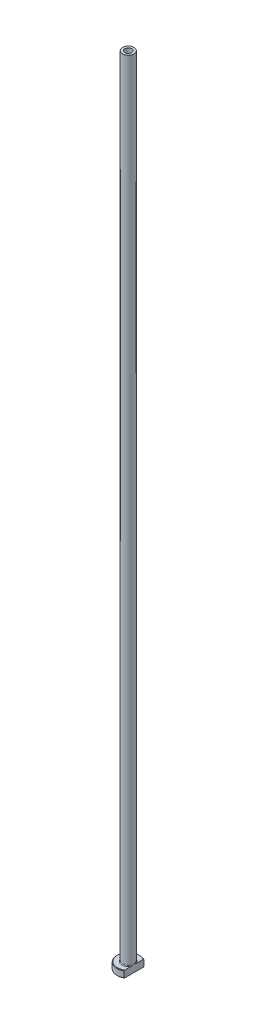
ISO-10303-21;
HEADER;
FILE_DESCRIPTION(('STEP AP214'),'2;1');
FILE_NAME('part.step','',(''),(''),'','','');
FILE_SCHEMA(('AUTOMOTIVE_DESIGN { 1 0 10303 214 1 1 1 1 }'));
ENDSEC;
DATA;
#1=APPLICATION_CONTEXT('core data for automotive mechanical design processes');
#2=APPLICATION_PROTOCOL_DEFINITION('international standard','automotive_design',2000,#1);
#3=PRODUCT_CONTEXT('',#1,'mechanical');
#4=PRODUCT('Part','Part','',(#3));
#5=PRODUCT_RELATED_PRODUCT_CATEGORY('part','',(#4));
#6=PRODUCT_DEFINITION_FORMATION('','',#4);
#7=PRODUCT_DEFINITION_CONTEXT('part definition',#1,'design');
#8=PRODUCT_DEFINITION('design','',#6,#7);
#9=PRODUCT_DEFINITION_SHAPE('','',#8);
#10=(LENGTH_UNIT() NAMED_UNIT(*) SI_UNIT(.MILLI.,.METRE.));
#11=(NAMED_UNIT(*) PLANE_ANGLE_UNIT() SI_UNIT($,.RADIAN.));
#12=(NAMED_UNIT(*) SI_UNIT($,.STERADIAN.) SOLID_ANGLE_UNIT());
#13=UNCERTAINTY_MEASURE_WITH_UNIT(LENGTH_MEASURE(1.E-05),#10,'distance_accuracy_value','');
#14=(GEOMETRIC_REPRESENTATION_CONTEXT(3) GLOBAL_UNCERTAINTY_ASSIGNED_CONTEXT((#13)) GLOBAL_UNIT_ASSIGNED_CONTEXT((#10,
#11,#12)) REPRESENTATION_CONTEXT('',''));
#15=CARTESIAN_POINT('',(0.,0.,0.));
#16=DIRECTION('',(0.,0.,1.));
#17=DIRECTION('',(1.,0.,0.));
#18=AXIS2_PLACEMENT_3D('',#15,#16,#17);
#19=CARTESIAN_POINT('',(0.,92.1876809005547,0.));
#20=DIRECTION('',(0.,1.,0.));
#21=DIRECTION('',(0.,0.,1.));
#22=AXIS2_PLACEMENT_3D('',#19,#20,#21);
#23=CYLINDRICAL_SURFACE('',#22,1.50000000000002);
#24=CARTESIAN_POINT('',(0.,350.,0.));
#25=DIRECTION('',(0.,1.,0.));
#26=DIRECTION('',(0.,0.,1.));
#27=AXIS2_PLACEMENT_3D('',#24,#25,#26);
#28=CIRCLE('',#27,1.50000000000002);
#29=CARTESIAN_POINT('',(0.,350.,1.50000000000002));
#30=VERTEX_POINT('',#29);
#31=EDGE_CURVE('E167',#30,#30,#28,.T.);
#32=ORIENTED_EDGE('',*,*,#31,.T.);
#33=EDGE_LOOP('',(#32));
#34=FACE_BOUND('',#33,.T.);
#35=CARTESIAN_POINT('',(0.,305.,0.));
#36=DIRECTION('',(0.,1.,0.));
#37=DIRECTION('',(0.,0.,1.));
#38=AXIS2_PLACEMENT_3D('',#35,#36,#37);
#39=CIRCLE('',#38,1.50000000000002);
#40=CARTESIAN_POINT('',(0.,305.,1.50000000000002));
#41=VERTEX_POINT('',#40);
#42=EDGE_CURVE('E170',#41,#41,#39,.T.);
#43=ORIENTED_EDGE('',*,*,#42,.F.);
#44=EDGE_LOOP('',(#43));
#45=FACE_BOUND('',#44,.T.);
#46=ADVANCED_FACE('F32',(#34,#45),#23,.F.);
#47=CARTESIAN_POINT('',(-1.50000000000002,350.,0.));
#48=DIRECTION('',(0.,1.,0.));
#49=DIRECTION('',(0.,0.,1.));
#50=AXIS2_PLACEMENT_3D('',#47,#48,#49);
#51=PLANE('',#50);
#52=CARTESIAN_POINT('',(0.,350.,0.));
#53=DIRECTION('',(0.,1.,0.));
#54=DIRECTION('',(0.,0.,1.));
#55=AXIS2_PLACEMENT_3D('',#52,#53,#54);
#56=CIRCLE('',#55,2.50000000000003);
#57=CARTESIAN_POINT('',(0.,350.,2.50000000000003));
#58=VERTEX_POINT('',#57);
#59=EDGE_CURVE('E174',#58,#58,#56,.T.);
#60=ORIENTED_EDGE('',*,*,#59,.T.);
#61=EDGE_LOOP('',(#60));
#62=FACE_BOUND('',#61,.T.);
#63=ORIENTED_EDGE('',*,*,#31,.F.);
#64=EDGE_LOOP('',(#63));
#65=FACE_BOUND('',#64,.T.);
#66=ADVANCED_FACE('F157',(#62,#65),#51,.T.);
#67=CARTESIAN_POINT('',(0.,92.1876809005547,0.));
#68=DIRECTION('',(0.,1.,0.));
#69=DIRECTION('',(0.,0.,1.));
#70=AXIS2_PLACEMENT_3D('',#67,#68,#69);
#71=CYLINDRICAL_SURFACE('',#70,2.50000000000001);
#72=CARTESIAN_POINT('',(0.,3.3,0.));
#73=DIRECTION('',(0.,1.,0.));
#74=DIRECTION('',(0.,0.,1.));
#75=AXIS2_PLACEMENT_3D('',#72,#73,#74);
#76=CIRCLE('',#75,2.50000000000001);
#77=CARTESIAN_POINT('',(2.5,3.3,0.));
#78=VERTEX_POINT('',#77);
#79=EDGE_CURVE('E180',#78,#78,#76,.T.);
#80=ORIENTED_EDGE('',*,*,#79,.T.);
#81=EDGE_LOOP('',(#80));
#82=FACE_BOUND('',#81,.T.);
#83=ORIENTED_EDGE('',*,*,#59,.F.);
#84=EDGE_LOOP('',(#83));
#85=FACE_BOUND('',#84,.T.);
#86=ADVANCED_FACE('F162',(#82,#85),#71,.T.);
#87=CARTESIAN_POINT('',(-2.49999999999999,3.,0.));
#88=DIRECTION('',(0.,1.,0.));
#89=DIRECTION('',(0.,0.,1.));
#90=AXIS2_PLACEMENT_3D('',#87,#88,#89);
#91=PLANE('',#90);
#92=DIRECTION('',(0.,0.,1.));
#93=VECTOR('',#92,1.);
#94=CARTESIAN_POINT('',(2.49999999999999,3.,0.));
#95=LINE('',#94,#93);
#96=CARTESIAN_POINT('',(2.5,3.,-4.09756024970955));
#97=VERTEX_POINT('',#96);
#98=CARTESIAN_POINT('',(2.49999999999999,3.,-1.26095202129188));
#99=VERTEX_POINT('',#98);
#100=EDGE_CURVE('E54',#97,#99,#95,.T.);
#101=ORIENTED_EDGE('',*,*,#100,.F.);
#102=CARTESIAN_POINT('',(0.,3.,0.));
#103=DIRECTION('',(0.,1.,0.));
#104=DIRECTION('',(0.,0.,1.));
#105=AXIS2_PLACEMENT_3D('',#102,#103,#104);
#106=CIRCLE('',#105,4.79999999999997);
#107=CARTESIAN_POINT('',(2.49999999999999,3.,4.09756024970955));
#108=VERTEX_POINT('',#107);
#109=EDGE_CURVE('E186',#97,#108,#106,.T.);
#110=ORIENTED_EDGE('',*,*,#109,.T.);
#111=CARTESIAN_POINT('',(2.49999999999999,3.,1.26095202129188));
#112=VERTEX_POINT('',#111);
#113=EDGE_CURVE('E134',#112,#108,#95,.T.);
#114=ORIENTED_EDGE('',*,*,#113,.F.);
#115=CARTESIAN_POINT('',(0.,3.,0.));
#116=DIRECTION('',(0.,1.,0.));
#117=DIRECTION('',(0.,0.,1.));
#118=AXIS2_PLACEMENT_3D('',#115,#116,#117);
#119=CIRCLE('',#118,2.80000000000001);
#120=EDGE_CURVE('E183',#112,#99,#119,.F.);
#121=ORIENTED_EDGE('',*,*,#120,.T.);
#122=EDGE_LOOP('',(#101,#110,#114,#121));
#123=FACE_BOUND('',#122,.T.);
#124=ADVANCED_FACE('F197',(#123),#91,.T.);
#125=CARTESIAN_POINT('',(0.,92.1876809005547,0.));
#126=DIRECTION('',(0.,1.,0.));
#127=DIRECTION('',(0.,0.,1.));
#128=AXIS2_PLACEMENT_3D('',#125,#126,#127);
#129=CYLINDRICAL_SURFACE('',#128,4.99999999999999);
#130=DIRECTION('',(0.,-1.,0.));
#131=VECTOR('',#130,1.);
#132=CARTESIAN_POINT('',(2.49999999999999,350.,4.33012701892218));
#133=LINE('',#132,#131);
#134=CARTESIAN_POINT('',(2.49999999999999,2.80000000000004,4.33012701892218));
#135=VERTEX_POINT('',#134);
#136=CARTESIAN_POINT('',(2.49999999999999,0.200000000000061,4.33012701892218));
#137=VERTEX_POINT('',#136);
#138=EDGE_CURVE('E82',#135,#137,#133,.T.);
#139=ORIENTED_EDGE('',*,*,#138,.F.);
#140=CARTESIAN_POINT('',(0.,2.80000000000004,0.));
#141=DIRECTION('',(0.,1.,0.));
#142=DIRECTION('',(0.,0.,1.));
#143=AXIS2_PLACEMENT_3D('',#140,#141,#142);
#144=CIRCLE('',#143,4.99999999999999);
#145=CARTESIAN_POINT('',(2.5,2.80000000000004,-4.33012701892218));
#146=VERTEX_POINT('',#145);
#147=EDGE_CURVE('E95',#135,#146,#144,.F.);
#148=ORIENTED_EDGE('',*,*,#147,.T.);
#149=DIRECTION('',(0.,-1.,0.));
#150=VECTOR('',#149,1.);
#151=CARTESIAN_POINT('',(2.5,350.,-4.33012701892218));
#152=LINE('',#151,#150);
#153=CARTESIAN_POINT('',(2.5,0.200000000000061,-4.33012701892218));
#154=VERTEX_POINT('',#153);
#155=EDGE_CURVE('E192',#146,#154,#152,.T.);
#156=ORIENTED_EDGE('',*,*,#155,.T.);
#157=CARTESIAN_POINT('',(0.,0.200000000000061,0.));
#158=DIRECTION('',(0.,-1.,0.));
#159=DIRECTION('',(0.,0.,-1.));
#160=AXIS2_PLACEMENT_3D('',#157,#158,#159);
#161=CIRCLE('',#160,4.99999999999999);
#162=EDGE_CURVE('E98',#154,#137,#161,.F.);
#163=ORIENTED_EDGE('',*,*,#162,.T.);
#164=EDGE_LOOP('',(#139,#148,#156,#163));
#165=FACE_BOUND('',#164,.T.);
#166=ADVANCED_FACE('F190',(#165),#129,.T.);
#167=CARTESIAN_POINT('',(-4.99999999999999,0.,0.));
#168=DIRECTION('',(0.,-1.,0.));
#169=DIRECTION('',(0.,0.,-1.));
#170=AXIS2_PLACEMENT_3D('',#167,#168,#169);
#171=PLANE('',#170);
#172=CARTESIAN_POINT('',(0.,0.,0.));
#173=DIRECTION('',(0.,-1.,0.));
#174=DIRECTION('',(0.,0.,-1.));
#175=AXIS2_PLACEMENT_3D('',#172,#173,#174);
#176=CIRCLE('',#175,2.24999999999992);
#177=CARTESIAN_POINT('',(0.,0.,-2.24999999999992));
#178=VERTEX_POINT('',#177);
#179=EDGE_CURVE('E40',#178,#178,#176,.F.);
#180=ORIENTED_EDGE('',*,*,#179,.T.);
#181=EDGE_LOOP('',(#180));
#182=FACE_BOUND('',#181,.T.);
#183=DIRECTION('',(0.,0.,-1.));
#184=VECTOR('',#183,1.);
#185=CARTESIAN_POINT('',(2.49999999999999,0.,4.33012701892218));
#186=LINE('',#185,#184);
#187=CARTESIAN_POINT('',(2.49999999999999,0.,4.09756024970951));
#188=VERTEX_POINT('',#187);
#189=CARTESIAN_POINT('',(2.5,0.,-4.09756024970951));
#190=VERTEX_POINT('',#189);
#191=EDGE_CURVE('E47',#188,#190,#186,.T.);
#192=ORIENTED_EDGE('',*,*,#191,.F.);
#193=CARTESIAN_POINT('',(0.,0.,0.));
#194=DIRECTION('',(0.,-1.,0.));
#195=DIRECTION('',(0.,0.,-1.));
#196=AXIS2_PLACEMENT_3D('',#193,#194,#195);
#197=CIRCLE('',#196,4.79999999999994);
#198=EDGE_CURVE('E92',#188,#190,#197,.T.);
#199=ORIENTED_EDGE('',*,*,#198,.T.);
#200=EDGE_LOOP('',(#192,#199));
#201=FACE_BOUND('',#200,.T.);
#202=ADVANCED_FACE('F91',(#182,#201),#171,.T.);
#203=CARTESIAN_POINT('',(0.,92.1876809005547,0.));
#204=DIRECTION('',(0.,1.,0.));
#205=DIRECTION('',(0.,0.,1.));
#206=AXIS2_PLACEMENT_3D('',#203,#204,#205);
#207=CYLINDRICAL_SURFACE('',#206,1.75000000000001);
#208=CARTESIAN_POINT('',(0.,0.499999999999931,0.));
#209=DIRECTION('',(0.,-1.,0.));
#210=DIRECTION('',(0.,0.,-1.));
#211=AXIS2_PLACEMENT_3D('',#208,#209,#210);
#212=CIRCLE('',#211,1.75000000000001);
#213=CARTESIAN_POINT('',(0.,0.499999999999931,-1.75000000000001));
#214=VERTEX_POINT('',#213);
#215=EDGE_CURVE('E11',#214,#214,#212,.T.);
#216=ORIENTED_EDGE('',*,*,#215,.T.);
#217=EDGE_LOOP('',(#216));
#218=FACE_BOUND('',#217,.T.);
#219=CARTESIAN_POINT('',(0.,293.,0.));
#220=DIRECTION('',(0.,1.,0.));
#221=DIRECTION('',(0.,0.,1.));
#222=AXIS2_PLACEMENT_3D('',#219,#220,#221);
#223=CIRCLE('',#222,1.75000000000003);
#224=CARTESIAN_POINT('',(0.,293.,1.75000000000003));
#225=VERTEX_POINT('',#224);
#226=EDGE_CURVE('E172',#225,#225,#223,.T.);
#227=ORIENTED_EDGE('',*,*,#226,.T.);
#228=EDGE_LOOP('',(#227));
#229=FACE_BOUND('',#228,.T.);
#230=ADVANCED_FACE('F215',(#218,#229),#207,.F.);
#231=CARTESIAN_POINT('',(0.,293.,0.));
#232=DIRECTION('',(0.,-1.,0.));
#233=DIRECTION('',(0.,0.,-1.));
#234=AXIS2_PLACEMENT_3D('',#231,#232,#233);
#235=CONICAL_SURFACE('',#234,1.75000000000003,0.0208303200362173);
#236=ORIENTED_EDGE('',*,*,#42,.T.);
#237=EDGE_LOOP('',(#236));
#238=FACE_BOUND('',#237,.T.);
#239=ORIENTED_EDGE('',*,*,#226,.F.);
#240=EDGE_LOOP('',(#239));
#241=FACE_BOUND('',#240,.T.);
#242=ADVANCED_FACE('F111',(#238,#241),#235,.F.);
#243=CARTESIAN_POINT('',(0.,3.3,0.));
#244=DIRECTION('',(0.,1.,0.));
#245=DIRECTION('',(0.,0.,1.));
#246=AXIS2_PLACEMENT_3D('',#243,#244,#245);
#247=TOROIDAL_SURFACE('',#246,2.80000000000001,0.3);
#248=ORIENTED_EDGE('',*,*,#120,.F.);
#249=CARTESIAN_POINT('',(2.5,3.3,0.));
#250=CARTESIAN_POINT('',(2.5,3.30000062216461,-4.84331418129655E-11));
#251=CARTESIAN_POINT('',(2.5,3.30000124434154,1.59621145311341E-07));
#252=CARTESIAN_POINT('',(2.5,3.30000243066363,6.45478212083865E-07));
#253=CARTESIAN_POINT('',(2.5,3.30000299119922,9.7848102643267E-07));
#254=CARTESIAN_POINT('',(2.5,3.3000041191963,1.77472029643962E-06));
#255=CARTESIAN_POINT('',(2.5,3.30000467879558,2.24902203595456E-06));
#256=CARTESIAN_POINT('',(2.5,3.30000572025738,3.25953752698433E-06));
#257=CARTESIAN_POINT('',(2.5,3.30000620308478,3.7948081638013E-06));
#258=CARTESIAN_POINT('',(2.5,3.30000787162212,5.75794754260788E-06));
#259=CARTESIAN_POINT('',(2.5,3.30000896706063,7.26424276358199E-06));
#260=CARTESIAN_POINT('',(2.5,3.30001087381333,1.03361149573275E-05));
#261=CARTESIAN_POINT('',(2.5,3.30001169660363,1.18949518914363E-05));
#262=CARTESIAN_POINT('',(2.5,3.30001489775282,1.81400885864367E-05));
#263=CARTESIAN_POINT('',(2.5,3.30001712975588,2.29062223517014E-05));
#264=CARTESIAN_POINT('',(2.5,3.30002067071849,3.21793921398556E-05));
#265=CARTESIAN_POINT('',(2.5,3.30002205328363,3.66589040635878E-05));
#266=CARTESIAN_POINT('',(2.5,3.30002810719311,5.61718487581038E-05));
#267=CARTESIAN_POINT('',(2.5,3.30003284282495,7.11735978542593E-05));
#268=CARTESIAN_POINT('',(2.5,3.30004025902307,9.89920465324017E-05));
#269=CARTESIAN_POINT('',(2.5,3.300043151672,0.000111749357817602));
#270=CARTESIAN_POINT('',(2.49999999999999,3.30006652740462,0.000206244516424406));
#271=CARTESIAN_POINT('',(2.49999999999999,3.30009698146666,0.000285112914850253));
#272=CARTESIAN_POINT('',(2.5,3.3002121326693,0.000594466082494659));
#273=CARTESIAN_POINT('',(2.5,3.30028938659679,0.000826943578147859));
#274=CARTESIAN_POINT('',(2.49999999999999,3.30059681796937,0.00173885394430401));
#275=CARTESIAN_POINT('',(2.49999999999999,3.30083479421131,0.00241625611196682));
#276=CARTESIAN_POINT('',(2.5,3.30181198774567,0.00521069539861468));
#277=CARTESIAN_POINT('',(2.5,3.30254240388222,0.00732996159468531));
#278=CARTESIAN_POINT('',(2.49999999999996,3.31226043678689,0.0355096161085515));
#279=CARTESIAN_POINT('',(2.49999999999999,3.32130808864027,0.0615551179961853));
#280=CARTESIAN_POINT('',(2.5,3.33896212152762,0.112677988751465));
#281=CARTESIAN_POINT('',(2.5,3.34757212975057,0.137754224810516));
#282=CARTESIAN_POINT('',(2.49999999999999,3.36573068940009,0.190981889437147));
#283=CARTESIAN_POINT('',(2.49999999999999,3.37526654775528,0.219137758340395));
#284=CARTESIAN_POINT('',(2.5,3.3942286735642,0.275816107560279));
#285=CARTESIAN_POINT('',(2.5,3.40365272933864,0.30433932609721));
#286=CARTESIAN_POINT('',(2.49999999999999,3.4264169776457,0.374416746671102));
#287=CARTESIAN_POINT('',(2.5,3.43959811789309,0.4160230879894));
#288=CARTESIAN_POINT('',(2.5,3.46479157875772,0.498481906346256));
#289=CARTESIAN_POINT('',(2.5,3.4768245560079,0.539328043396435));
#290=CARTESIAN_POINT('',(2.5,3.50224427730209,0.629981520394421));
#291=CARTESIAN_POINT('',(2.5,3.51538048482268,0.679860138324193));
#292=CARTESIAN_POINT('',(2.5,3.53964074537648,0.780511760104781));
#293=CARTESIAN_POINT('',(2.5,3.55074877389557,0.831288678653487));
#294=CARTESIAN_POINT('',(2.5,3.57087054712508,0.93706346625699));
#295=CARTESIAN_POINT('',(2.5,3.57967623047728,0.992102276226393));
#296=CARTESIAN_POINT('',(2.5,3.59301148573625,1.10256024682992));
#297=CARTESIAN_POINT('',(2.5,3.59755297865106,1.15797790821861));
#298=CARTESIAN_POINT('',(2.5,3.60093314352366,1.26786705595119));
#299=CARTESIAN_POINT('',(2.5,3.59989366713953,1.32233291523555));
#300=CARTESIAN_POINT('',(2.5,3.59277279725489,1.40310062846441));
#301=CARTESIAN_POINT('',(2.5,3.58952137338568,1.42965222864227));
#302=CARTESIAN_POINT('',(2.5,3.58085857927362,1.48239078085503));
#303=CARTESIAN_POINT('',(2.5,3.57544928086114,1.50857805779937));
#304=CARTESIAN_POINT('',(2.5,3.56298810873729,1.55658799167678));
#305=CARTESIAN_POINT('',(2.5,3.55628200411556,1.57849902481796));
#306=CARTESIAN_POINT('',(2.5,3.54055393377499,1.62160292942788));
#307=CARTESIAN_POINT('',(2.5,3.53152220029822,1.64279233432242));
#308=CARTESIAN_POINT('',(2.5,3.51057199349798,1.68404469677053));
#309=CARTESIAN_POINT('',(2.5,3.49862012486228,1.70409105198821));
#310=CARTESIAN_POINT('',(2.5,3.47134074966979,1.74172093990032));
#311=CARTESIAN_POINT('',(2.5,3.45603127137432,1.75931683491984));
#312=CARTESIAN_POINT('',(2.5,3.42979930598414,1.7829707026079));
#313=CARTESIAN_POINT('',(2.5,3.42024268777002,1.790541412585));
#314=CARTESIAN_POINT('',(2.5,3.40009035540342,1.80416997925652));
#315=CARTESIAN_POINT('',(2.5,3.38949499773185,1.81022835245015));
#316=CARTESIAN_POINT('',(2.5,3.36727740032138,1.82047087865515));
#317=CARTESIAN_POINT('',(2.5,3.35564531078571,1.82463409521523));
#318=CARTESIAN_POINT('',(2.5,3.33178837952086,1.83058442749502));
#319=CARTESIAN_POINT('',(2.5,3.31956435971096,1.83237474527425));
#320=CARTESIAN_POINT('',(2.5,3.2966573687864,1.8333185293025));
#321=CARTESIAN_POINT('',(2.5,3.28598670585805,1.83279233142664));
#322=CARTESIAN_POINT('',(2.5,3.26490749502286,1.82986307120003));
#323=CARTESIAN_POINT('',(2.5,3.2544989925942,1.82745968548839));
#324=CARTESIAN_POINT('',(2.5,3.23467098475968,1.8211125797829));
#325=CARTESIAN_POINT('',(2.5,3.22522816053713,1.81724026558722));
#326=CARTESIAN_POINT('',(2.5,3.20699535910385,1.8081949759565));
#327=CARTESIAN_POINT('',(2.5,3.19820556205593,1.80302164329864));
#328=CARTESIAN_POINT('',(2.5,3.17663162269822,1.78842115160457));
#329=CARTESIAN_POINT('',(2.5,3.16436228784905,1.77823293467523));
#330=CARTESIAN_POINT('',(2.5,3.14157828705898,1.75604629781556));
#331=CARTESIAN_POINT('',(2.5,3.13106906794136,1.74404246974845));
#332=CARTESIAN_POINT('',(2.5,3.10600520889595,1.71142114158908));
#333=CARTESIAN_POINT('',(2.5,3.09267476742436,1.68986887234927));
#334=CARTESIAN_POINT('',(2.5,3.06940323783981,1.64508572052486));
#335=CARTESIAN_POINT('',(2.5,3.05946314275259,1.6218543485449));
#336=CARTESIAN_POINT('',(2.5,3.03545750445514,1.55546754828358));
#337=CARTESIAN_POINT('',(2.5,3.02444022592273,1.51122187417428));
#338=CARTESIAN_POINT('',(2.5,3.00863926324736,1.42119777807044));
#339=CARTESIAN_POINT('',(2.5,3.00393876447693,1.37540689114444));
#340=CARTESIAN_POINT('',(2.5,2.9992421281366,1.28072198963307));
#341=CARTESIAN_POINT('',(2.5,2.99956098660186,1.23181420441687));
#342=CARTESIAN_POINT('',(2.5,3.00436098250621,1.1341094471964));
#343=CARTESIAN_POINT('',(2.5,3.00885327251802,1.08531312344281));
#344=CARTESIAN_POINT('',(2.5,3.02074191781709,0.990773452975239));
#345=CARTESIAN_POINT('',(2.5,3.02796792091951,0.945007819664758));
#346=CARTESIAN_POINT('',(2.5,3.04465555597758,0.854199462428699));
#347=CARTESIAN_POINT('',(2.5,3.05410250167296,0.809153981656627));
#348=CARTESIAN_POINT('',(2.5,3.07710029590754,0.709411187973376));
#349=CARTESIAN_POINT('',(2.5,3.09109633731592,0.654817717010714));
#350=CARTESIAN_POINT('',(2.5,3.12140740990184,0.544863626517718));
#351=CARTESIAN_POINT('',(2.49999999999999,3.13777040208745,0.489516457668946));
#352=CARTESIAN_POINT('',(2.5,3.16649540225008,0.396740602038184));
#353=CARTESIAN_POINT('',(2.5,3.1784813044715,0.359193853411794));
#354=CARTESIAN_POINT('',(2.49999999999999,3.20280507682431,0.284651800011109));
#355=CARTESIAN_POINT('',(2.49999999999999,3.21513791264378,0.247654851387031));
#356=CARTESIAN_POINT('',(2.5,3.23873713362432,0.177767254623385));
#357=CARTESIAN_POINT('',(2.50000000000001,3.2499740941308,0.144866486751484));
#358=CARTESIAN_POINT('',(2.49999999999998,3.27307149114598,0.0777985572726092));
#359=CARTESIAN_POINT('',(2.49999999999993,3.28493883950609,0.0436336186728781));
#360=CARTESIAN_POINT('',(2.5,3.2974579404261,0.00732879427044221));
#361=CARTESIAN_POINT('',(2.5,3.29818879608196,0.00520838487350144));
#362=CARTESIAN_POINT('',(2.49999999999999,3.29916610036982,0.00241367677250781));
#363=CARTESIAN_POINT('',(2.49999999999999,3.29940376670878,0.00173715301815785));
#364=CARTESIAN_POINT('',(2.5,3.29971082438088,0.000826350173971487));
#365=CARTESIAN_POINT('',(2.5,3.29978800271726,0.00059409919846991));
#366=CARTESIAN_POINT('',(2.49999999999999,3.29990305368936,0.000285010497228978));
#367=CARTESIAN_POINT('',(2.49999999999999,3.29993349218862,0.000206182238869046));
#368=CARTESIAN_POINT('',(2.5,3.29995685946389,0.000111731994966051));
#369=CARTESIAN_POINT('',(2.5,3.29995975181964,9.89774459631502E-05));
#370=CARTESIAN_POINT('',(2.5,3.29996716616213,7.11651995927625E-05));
#371=CARTESIAN_POINT('',(2.5,3.29997189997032,5.61668178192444E-05));
#372=CARTESIAN_POINT('',(2.5,3.29997795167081,3.66576379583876E-05));
#373=CARTESIAN_POINT('',(2.5,3.29997933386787,3.21785298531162E-05));
#374=CARTESIAN_POINT('',(2.5,3.29998287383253,2.29061419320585E-05));
#375=CARTESIAN_POINT('',(2.5,3.29998510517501,1.81403694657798E-05));
#376=CARTESIAN_POINT('',(2.5,3.29998830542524,1.18955841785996E-05));
#377=CARTESIAN_POINT('',(2.5,3.29998912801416,1.03367781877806E-05));
#378=CARTESIAN_POINT('',(2.5,3.29999103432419,7.26492948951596E-06));
#379=CARTESIAN_POINT('',(2.5,3.29999212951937,5.75862409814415E-06));
#380=CARTESIAN_POINT('',(2.5,3.29999379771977,3.79542544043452E-06));
#381=CARTESIAN_POINT('',(2.5,3.29999428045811,3.26012835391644E-06));
#382=CARTESIAN_POINT('',(2.5,3.29999532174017,2.24954393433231E-06));
#383=CARTESIAN_POINT('',(2.5,3.29999588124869,1.77519943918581E-06));
#384=CARTESIAN_POINT('',(2.5,3.29999700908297,9.78857422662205E-07));
#385=CARTESIAN_POINT('',(2.5,3.29999756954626,6.45797309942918E-07));
#386=CARTESIAN_POINT('',(2.5,3.29999875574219,1.59799707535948E-07));
#387=CARTESIAN_POINT('',(2.5,3.29999937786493,4.84313429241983E-11));
#388=CARTESIAN_POINT('',(2.5,3.3,0.));
#389=B_SPLINE_CURVE_WITH_KNOTS('',3,(#249,#250,#251,#252,#253,#254,#255,#256,#257,#258,#259,
#260,#261,#262,#263,#264,#265,#266,#267,#268,#269,#270,#271,#272,#273,#274,#275,#276,#277,#278,
#279,#280,#281,#282,#283,#284,#285,#286,#287,#288,#289,#290,#291,#292,#293,#294,#295,#296,#297,
#298,#299,#300,#301,#302,#303,#304,#305,#306,#307,#308,#309,#310,#311,#312,#313,#314,#315,#316,
#317,#318,#319,#320,#321,#322,#323,#324,#325,#326,#327,#328,#329,#330,#331,#332,#333,#334,#335,
#336,#337,#338,#339,#340,#341,#342,#343,#344,#345,#346,#347,#348,#349,#350,#351,#352,#353,#354,
#355,#356,#357,#358,#359,#360,#361,#362,#363,#364,#365,#366,#367,#368,#369,#370,#371,#372,#373,
#374,#375,#376,#377,#378,#379,#380,#381,#382,#383,#384,#385,#386,#387,#388),.UNSPECIFIED.,.T.,
.F.,(4,2,2,2,2,2,2,2,2,2,2,2,2,2,2,2,2,2,2,2,2,2,2,2,2,2,2,2,2,2,2,2,2,2,2,2,2,2,2,2,2,2,2,2,2,
2,2,2,2,2,2,2,2,2,2,2,2,2,2,2,2,2,2,2,2,2,2,2,2,4),(0.,1.86789035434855E-06,3.815492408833E-06,
6.00609972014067E-06,8.16652330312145E-06,1.37285513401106E-05,1.90122074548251E-05,
3.47597195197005E-05,4.88082497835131E-05,9.59978367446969E-05,0.000135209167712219,
0.000388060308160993,0.00112364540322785,0.00327678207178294,0.010002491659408,
0.0927120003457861,0.172253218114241,0.261432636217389,0.35155121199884,0.482477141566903,
0.610212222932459,0.76491521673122,0.920792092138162,1.08787897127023,1.25449733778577,
1.41749285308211,1.49767530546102,1.57778095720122,1.64642481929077,1.7153618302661,
1.78512750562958,1.85452737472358,1.89099315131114,1.92744645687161,1.96429324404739,
2.00109025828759,2.03297105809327,2.06485735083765,2.09535926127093,2.12586955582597,
2.17344034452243,2.22115572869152,2.29675134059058,2.37236907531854,2.50839721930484,
2.64619971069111,2.79268284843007,2.93955855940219,3.07848421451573,3.21651583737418,
3.38554045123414,3.55865938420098,3.67689643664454,3.79388863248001,3.89819085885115,
4.00668323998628,4.01341261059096,4.01556295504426,4.01629782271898,4.01655054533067,
4.01658974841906,4.01663692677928,4.01665097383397,4.01666671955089,4.01667200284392,
4.0166775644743,4.0166797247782,4.01668191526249,4.016683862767,4.01668573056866),.UNSPECIFIED.);
#390=EDGE_CURVE('E126',#112,#78,#389,.T.);
#391=ORIENTED_EDGE('',*,*,#390,.T.);
#392=ORIENTED_EDGE('',*,*,#79,.F.);
#393=CARTESIAN_POINT('',(2.5,3.3,0.));
#394=CARTESIAN_POINT('',(2.5,3.29999937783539,4.84339385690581E-11));
#395=CARTESIAN_POINT('',(2.5,3.29999875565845,-1.59621144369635E-07));
#396=CARTESIAN_POINT('',(2.5,3.29999756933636,-6.45478211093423E-07));
#397=CARTESIAN_POINT('',(2.5,3.29999700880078,-9.78481025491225E-07));
#398=CARTESIAN_POINT('',(2.5,3.29999588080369,-1.7747202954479E-06));
#399=CARTESIAN_POINT('',(2.5,3.29999532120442,-2.24902203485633E-06));
#400=CARTESIAN_POINT('',(2.5,3.29999427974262,-3.25953752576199E-06));
#401=CARTESIAN_POINT('',(2.5,3.29999379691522,-3.7948081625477E-06));
#402=CARTESIAN_POINT('',(2.5,3.29999212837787,-5.75794754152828E-06));
#403=CARTESIAN_POINT('',(2.5,3.29999103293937,-7.2642427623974E-06));
#404=CARTESIAN_POINT('',(2.5,3.29998912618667,-1.03361149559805E-05));
#405=CARTESIAN_POINT('',(2.5,3.29998830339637,-1.18949518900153E-05));
#406=CARTESIAN_POINT('',(2.5,3.29998510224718,-1.81400885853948E-05));
#407=CARTESIAN_POINT('',(2.5,3.29998287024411,-2.29062223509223E-05));
#408=CARTESIAN_POINT('',(2.5,3.2999793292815,-3.21793921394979E-05));
#409=CARTESIAN_POINT('',(2.5,3.29997794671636,-3.66589040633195E-05));
#410=CARTESIAN_POINT('',(2.5,3.29997189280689,-5.61718487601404E-05));
#411=CARTESIAN_POINT('',(2.5,3.29996715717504,-7.11735978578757E-05));
#412=CARTESIAN_POINT('',(2.5,3.29995974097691,-9.899204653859E-05));
#413=CARTESIAN_POINT('',(2.5,3.29995684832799,-0.000111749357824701));
#414=CARTESIAN_POINT('',(2.49999999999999,3.29993347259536,-0.000206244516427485));
#415=CARTESIAN_POINT('',(2.49999999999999,3.29990301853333,-0.000285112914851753));
#416=CARTESIAN_POINT('',(2.5,3.29978786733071,-0.000594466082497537));
#417=CARTESIAN_POINT('',(2.5,3.29971061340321,-0.000826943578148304));
#418=CARTESIAN_POINT('',(2.49999999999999,3.29940318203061,-0.00173885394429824));
#419=CARTESIAN_POINT('',(2.49999999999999,3.29916520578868,-0.00241625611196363));
#420=CARTESIAN_POINT('',(2.5,3.29818801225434,-0.0052106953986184));
#421=CARTESIAN_POINT('',(2.5,3.29745759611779,-0.00732996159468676));
#422=CARTESIAN_POINT('',(2.49999999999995,3.28773956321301,-0.0355096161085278));
#423=CARTESIAN_POINT('',(2.49999999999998,3.2786919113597,-0.0615551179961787));
#424=CARTESIAN_POINT('',(2.50000000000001,3.2610378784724,-0.11267798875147));
#425=CARTESIAN_POINT('',(2.5,3.25242787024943,-0.137754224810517));
#426=CARTESIAN_POINT('',(2.49999999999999,3.23426931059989,-0.190981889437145));
#427=CARTESIAN_POINT('',(2.49999999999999,3.22473345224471,-0.219137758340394));
#428=CARTESIAN_POINT('',(2.5,3.2057713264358,-0.275816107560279));
#429=CARTESIAN_POINT('',(2.5,3.19634727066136,-0.304339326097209));
#430=CARTESIAN_POINT('',(2.49999999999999,3.1735830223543,-0.374416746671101));
#431=CARTESIAN_POINT('',(2.5,3.1604018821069,-0.416023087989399));
#432=CARTESIAN_POINT('',(2.5,3.13520842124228,-0.498481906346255));
#433=CARTESIAN_POINT('',(2.5,3.12317544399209,-0.539328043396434));
#434=CARTESIAN_POINT('',(2.5,3.09775572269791,-0.629981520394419));
#435=CARTESIAN_POINT('',(2.5,3.08461951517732,-0.679860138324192));
#436=CARTESIAN_POINT('',(2.5,3.06035925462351,-0.780511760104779));
#437=CARTESIAN_POINT('',(2.5,3.04925122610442,-0.831288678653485));
#438=CARTESIAN_POINT('',(2.5,3.02912945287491,-0.937063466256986));
#439=CARTESIAN_POINT('',(2.5,3.02032376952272,-0.992102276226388));
#440=CARTESIAN_POINT('',(2.5,3.00698851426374,-1.10256024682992));
#441=CARTESIAN_POINT('',(2.5,3.00244702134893,-1.1579779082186));
#442=CARTESIAN_POINT('',(2.5,2.99906685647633,-1.26786705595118));
#443=CARTESIAN_POINT('',(2.5,3.00010633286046,-1.32233291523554));
#444=CARTESIAN_POINT('',(2.5,3.00722720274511,-1.4031006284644));
#445=CARTESIAN_POINT('',(2.5,3.01047862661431,-1.42965222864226));
#446=CARTESIAN_POINT('',(2.5,3.01914142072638,-1.48239078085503));
#447=CARTESIAN_POINT('',(2.5,3.02455071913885,-1.50857805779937));
#448=CARTESIAN_POINT('',(2.5,3.0370118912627,-1.55658799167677));
#449=CARTESIAN_POINT('',(2.5,3.04371799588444,-1.57849902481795));
#450=CARTESIAN_POINT('',(2.5,3.05944606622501,-1.62160292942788));
#451=CARTESIAN_POINT('',(2.5,3.06847779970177,-1.64279233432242));
#452=CARTESIAN_POINT('',(2.5,3.08942800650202,-1.68404469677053));
#453=CARTESIAN_POINT('',(2.5,3.10137987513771,-1.70409105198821));
#454=CARTESIAN_POINT('',(2.5,3.1286592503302,-1.74172093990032));
#455=CARTESIAN_POINT('',(2.5,3.14396872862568,-1.75931683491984));
#456=CARTESIAN_POINT('',(2.5,3.17020069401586,-1.7829707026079));
#457=CARTESIAN_POINT('',(2.5,3.17975731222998,-1.79054141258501));
#458=CARTESIAN_POINT('',(2.5,3.19990964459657,-1.80416997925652));
#459=CARTESIAN_POINT('',(2.5,3.21050500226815,-1.81022835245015));
#460=CARTESIAN_POINT('',(2.5,3.23272259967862,-1.82047087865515));
#461=CARTESIAN_POINT('',(2.5,3.24435468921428,-1.82463409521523));
#462=CARTESIAN_POINT('',(2.5,3.26821162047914,-1.83058442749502));
#463=CARTESIAN_POINT('',(2.5,3.28043564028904,-1.83237474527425));
#464=CARTESIAN_POINT('',(2.5,3.3033426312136,-1.8333185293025));
#465=CARTESIAN_POINT('',(2.5,3.31401329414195,-1.83279233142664));
#466=CARTESIAN_POINT('',(2.5,3.33509250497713,-1.82986307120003));
#467=CARTESIAN_POINT('',(2.5,3.34550100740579,-1.82745968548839));
#468=CARTESIAN_POINT('',(2.5,3.36532901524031,-1.8211125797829));
#469=CARTESIAN_POINT('',(2.5,3.37477183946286,-1.81724026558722));
#470=CARTESIAN_POINT('',(2.5,3.39300464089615,-1.8081949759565));
#471=CARTESIAN_POINT('',(2.5,3.40179443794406,-1.80302164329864));
#472=CARTESIAN_POINT('',(2.5,3.42336837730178,-1.78842115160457));
#473=CARTESIAN_POINT('',(2.5,3.43563771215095,-1.77823293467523));
#474=CARTESIAN_POINT('',(2.5,3.45842171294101,-1.75604629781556));
#475=CARTESIAN_POINT('',(2.5,3.46893093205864,-1.74404246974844));
#476=CARTESIAN_POINT('',(2.5,3.49399479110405,-1.71142114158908));
#477=CARTESIAN_POINT('',(2.5,3.50732523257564,-1.68986887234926));
#478=CARTESIAN_POINT('',(2.5,3.53059676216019,-1.64508572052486));
#479=CARTESIAN_POINT('',(2.5,3.54053685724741,-1.62185434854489));
#480=CARTESIAN_POINT('',(2.5,3.56454249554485,-1.55546754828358));
#481=CARTESIAN_POINT('',(2.5,3.57555977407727,-1.51122187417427));
#482=CARTESIAN_POINT('',(2.5,3.59136073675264,-1.42119777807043));
#483=CARTESIAN_POINT('',(2.5,3.59606123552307,-1.37540689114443));
#484=CARTESIAN_POINT('',(2.5,3.60075787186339,-1.28072198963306));
#485=CARTESIAN_POINT('',(2.5,3.60043901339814,-1.23181420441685));
#486=CARTESIAN_POINT('',(2.5,3.59563901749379,-1.13410944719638));
#487=CARTESIAN_POINT('',(2.5,3.59114672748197,-1.08531312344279));
#488=CARTESIAN_POINT('',(2.5,3.5792580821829,-0.990773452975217));
#489=CARTESIAN_POINT('',(2.5,3.57203207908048,-0.945007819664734));
#490=CARTESIAN_POINT('',(2.5,3.55534444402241,-0.854199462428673));
#491=CARTESIAN_POINT('',(2.5,3.54589749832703,-0.8091539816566));
#492=CARTESIAN_POINT('',(2.5,3.52289970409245,-0.709411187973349));
#493=CARTESIAN_POINT('',(2.5,3.50890366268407,-0.654817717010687));
#494=CARTESIAN_POINT('',(2.5,3.47859259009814,-0.5448636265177));
#495=CARTESIAN_POINT('',(2.49999999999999,3.46222959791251,-0.489516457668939));
#496=CARTESIAN_POINT('',(2.5,3.43350459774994,-0.396740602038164));
#497=CARTESIAN_POINT('',(2.5,3.42151869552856,-0.359193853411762));
#498=CARTESIAN_POINT('',(2.49999999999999,3.39719492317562,-0.284651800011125));
#499=CARTESIAN_POINT('',(2.49999999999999,3.38486208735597,-0.247654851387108));
#500=CARTESIAN_POINT('',(2.5,3.36126286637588,-0.177767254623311));
#501=CARTESIAN_POINT('',(2.50000000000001,3.35002590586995,-0.144866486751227));
#502=CARTESIAN_POINT('',(2.49999999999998,3.32692850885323,-0.0777985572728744));
#503=CARTESIAN_POINT('',(2.49999999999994,3.31506116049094,-0.0436336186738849));
#504=CARTESIAN_POINT('',(2.5,3.30254205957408,-0.00732879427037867));
#505=CARTESIAN_POINT('',(2.5,3.30181120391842,-0.00520838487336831));
#506=CARTESIAN_POINT('',(2.49999999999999,3.30083389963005,-0.00241367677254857));
#507=CARTESIAN_POINT('',(2.49999999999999,3.30059623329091,-0.00173715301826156));
#508=CARTESIAN_POINT('',(2.5,3.30028917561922,-0.000826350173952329));
#509=CARTESIAN_POINT('',(2.5,3.30021199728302,-0.000594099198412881));
#510=CARTESIAN_POINT('',(2.49999999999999,3.30009694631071,-0.000285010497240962));
#511=CARTESIAN_POINT('',(2.49999999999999,3.30006650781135,-0.000206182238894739));
#512=CARTESIAN_POINT('',(2.5,3.30004314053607,-0.000111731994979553));
#513=CARTESIAN_POINT('',(2.5,3.30004024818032,-9.89774459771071E-05));
#514=CARTESIAN_POINT('',(2.5,3.30003283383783,-7.11651996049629E-05));
#515=CARTESIAN_POINT('',(2.5,3.30002810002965,-5.6166817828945E-05));
#516=CARTESIAN_POINT('',(2.5,3.30002204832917,-3.66576379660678E-05));
#517=CARTESIAN_POINT('',(2.5,3.30002066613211,-3.21785298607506E-05));
#518=CARTESIAN_POINT('',(2.5,3.30001712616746,-2.29061419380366E-05));
#519=CARTESIAN_POINT('',(2.5,3.30001489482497,-1.81403694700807E-05));
#520=CARTESIAN_POINT('',(2.5,3.30001169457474,-1.18955841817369E-05));
#521=CARTESIAN_POINT('',(2.5,3.30001087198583,-1.03367781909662E-05));
#522=CARTESIAN_POINT('',(2.5,3.3000089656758,-7.26492949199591E-06));
#523=CARTESIAN_POINT('',(2.5,3.30000787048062,-5.75862409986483E-06));
#524=CARTESIAN_POINT('',(2.5,3.30000620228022,-3.79542544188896E-06));
#525=CARTESIAN_POINT('',(2.5,3.30000571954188,-3.26012835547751E-06));
#526=CARTESIAN_POINT('',(2.5,3.30000467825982,-2.24954393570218E-06));
#527=CARTESIAN_POINT('',(2.5,3.3000041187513,-1.77519944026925E-06));
#528=CARTESIAN_POINT('',(2.5,3.30000299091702,-9.78857423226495E-07));
#529=CARTESIAN_POINT('',(2.5,3.30000243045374,-6.45797310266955E-07));
#530=CARTESIAN_POINT('',(2.5,3.3000012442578,-1.59799707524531E-07));
#531=CARTESIAN_POINT('',(2.5,3.30000062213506,-4.84311380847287E-11));
#532=CARTESIAN_POINT('',(2.5,3.3,0.));
#533=B_SPLINE_CURVE_WITH_KNOTS('',3,(#393,#394,#395,#396,#397,#398,#399,#400,#401,#402,#403,
#404,#405,#406,#407,#408,#409,#410,#411,#412,#413,#414,#415,#416,#417,#418,#419,#420,#421,#422,
#423,#424,#425,#426,#427,#428,#429,#430,#431,#432,#433,#434,#435,#436,#437,#438,#439,#440,#441,
#442,#443,#444,#445,#446,#447,#448,#449,#450,#451,#452,#453,#454,#455,#456,#457,#458,#459,#460,
#461,#462,#463,#464,#465,#466,#467,#468,#469,#470,#471,#472,#473,#474,#475,#476,#477,#478,#479,
#480,#481,#482,#483,#484,#485,#486,#487,#488,#489,#490,#491,#492,#493,#494,#495,#496,#497,#498,
#499,#500,#501,#502,#503,#504,#505,#506,#507,#508,#509,#510,#511,#512,#513,#514,#515,#516,#517,
#518,#519,#520,#521,#522,#523,#524,#525,#526,#527,#528,#529,#530,#531,#532),.UNSPECIFIED.,.T.,
.F.,(4,2,2,2,2,2,2,2,2,2,2,2,2,2,2,2,2,2,2,2,2,2,2,2,2,2,2,2,2,2,2,2,2,2,2,2,2,2,2,2,2,2,2,2,2,
2,2,2,2,2,2,2,2,2,2,2,2,2,2,2,2,2,2,2,2,2,2,2,2,4),(0.,1.86789035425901E-06,
3.81549240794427E-06,6.00609971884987E-06,8.16652330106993E-06,1.37285513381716E-05,
1.9012207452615E-05,3.47597195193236E-05,4.88082497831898E-05,9.59978367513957E-05,
0.000135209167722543,0.000388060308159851,0.00112364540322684,0.00327678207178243,
0.0100024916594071,0.0927120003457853,0.172253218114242,0.261432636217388,0.351551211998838,
0.482477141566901,0.610212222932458,0.764915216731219,0.920792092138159,1.08787897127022,
1.25449733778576,1.4174928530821,1.49767530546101,1.57778095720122,1.64642481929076,
1.71536183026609,1.78512750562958,1.85452737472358,1.89099315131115,1.92744645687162,
1.9642932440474,2.0010902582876,2.03297105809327,2.06485735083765,2.09535926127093,
2.12586955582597,2.17344034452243,2.22115572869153,2.29675134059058,2.37236907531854,
2.50839721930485,2.64619971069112,2.79268284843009,2.93955855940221,3.07848421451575,
3.21651583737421,3.38554045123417,3.55865938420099,3.67689643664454,3.79388863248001,
3.89819085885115,4.00668323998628,4.01341261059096,4.01556295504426,4.01629782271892,
4.01655054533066,4.01658974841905,4.01663692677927,4.01665097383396,4.01666671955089,
4.01667200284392,4.0166775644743,4.0166797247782,4.01668191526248,4.01668386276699,
4.01668573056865),.UNSPECIFIED.);
#534=EDGE_CURVE('E135',#78,#99,#533,.T.);
#535=ORIENTED_EDGE('',*,*,#534,.T.);
#536=EDGE_LOOP('',(#248,#391,#392,#535));
#537=FACE_BOUND('',#536,.T.);
#538=ADVANCED_FACE('F141',(#537),#247,.F.);
#539=CARTESIAN_POINT('',(0.,3.,0.));
#540=DIRECTION('',(0.,-1.,0.));
#541=DIRECTION('',(0.,0.,-1.));
#542=AXIS2_PLACEMENT_3D('',#539,#540,#541);
#543=CONICAL_SURFACE('',#542,4.79999999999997,0.785398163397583);
#544=CARTESIAN_POINT('',(2.5,-2.05039133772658,-9.52786489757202));
#545=CARTESIAN_POINT('',(2.5,-1.84160367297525,-9.31199733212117));
#546=CARTESIAN_POINT('',(2.5,-1.63304008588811,-9.09591231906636));
#547=CARTESIAN_POINT('',(2.5,-1.21649358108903,-8.66317810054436));
#548=CARTESIAN_POINT('',(2.5,-1.00851067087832,-8.44652888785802));
#549=CARTESIAN_POINT('',(2.5,-0.593157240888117,-8.01243155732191));
#550=CARTESIAN_POINT('',(2.5,-0.385787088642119,-7.79498308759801));
#551=CARTESIAN_POINT('',(2.5,0.0280365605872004,-7.35921771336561));
#552=CARTESIAN_POINT('',(2.5,0.234490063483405,-7.14090081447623));
#553=CARTESIAN_POINT('',(2.5,0.642130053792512,-6.70748960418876));
#554=CARTESIAN_POINT('',(2.5,0.84333981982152,-6.49241720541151));
#555=CARTESIAN_POINT('',(2.5,1.2442538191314,-6.06087422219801));
#556=CARTESIAN_POINT('',(2.5,1.44395806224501,-5.84440364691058));
#557=CARTESIAN_POINT('',(2.5,1.84127751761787,-5.40963663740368));
#558=CARTESIAN_POINT('',(2.5,2.03889317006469,-5.19134060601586));
#559=CARTESIAN_POINT('',(2.5,2.4312504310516,-4.75218509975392));
#560=CARTESIAN_POINT('',(2.5,2.62599215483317,-4.53132572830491));
#561=CARTESIAN_POINT('',(2.5,2.93693788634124,-4.17181619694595));
#562=CARTESIAN_POINT('',(2.5,3.05446493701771,-4.03431188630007));
#563=CARTESIAN_POINT('',(2.5,3.28742704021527,-3.75751486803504));
#564=CARTESIAN_POINT('',(2.5,3.4028618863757,-3.61822198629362));
#565=CARTESIAN_POINT('',(2.5,3.63213234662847,-3.33586492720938));
#566=CARTESIAN_POINT('',(2.5,3.74593818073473,-3.19277645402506));
#567=CARTESIAN_POINT('',(2.5,3.96956266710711,-2.90356071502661));
#568=CARTESIAN_POINT('',(2.5,4.07938227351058,-2.75743418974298));
#569=CARTESIAN_POINT('',(2.5,4.29502410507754,-2.45881038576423));
#570=CARTESIAN_POINT('',(2.5,4.40076032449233,-2.306250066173));
#571=CARTESIAN_POINT('',(2.5,4.55286945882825,-2.07299325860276));
#572=CARTESIAN_POINT('',(2.5,4.60252613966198,-1.99444197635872));
#573=CARTESIAN_POINT('',(2.5,4.69908164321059,-1.83566827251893));
#574=CARTESIAN_POINT('',(2.5,4.74598077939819,-1.75544604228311));
#575=CARTESIAN_POINT('',(2.5,4.83578466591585,-1.59405362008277));
#576=CARTESIAN_POINT('',(2.5,4.8787312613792,-1.51290702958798));
#577=CARTESIAN_POINT('',(2.5,4.96038600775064,-1.34852090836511));
#578=CARTESIAN_POINT('',(2.5,4.99909338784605,-1.26528100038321));
#579=CARTESIAN_POINT('',(2.5,5.10703093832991,-1.01251774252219));
#580=CARTESIAN_POINT('',(2.5,5.16843307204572,-0.839342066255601));
#581=CARTESIAN_POINT('',(2.5,5.23490554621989,-0.579703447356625));
#582=CARTESIAN_POINT('',(2.5,5.25253806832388,-0.496421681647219));
#583=CARTESIAN_POINT('',(2.5,5.27986337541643,-0.328535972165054));
#584=CARTESIAN_POINT('',(2.5,5.28955686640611,-0.24393214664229));
#585=CARTESIAN_POINT('',(2.5,5.30031768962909,-0.0744340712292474));
#586=CARTESIAN_POINT('',(2.5,5.30141176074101,0.0104584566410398));
#587=CARTESIAN_POINT('',(2.5,5.29496530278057,0.179916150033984));
#588=CARTESIAN_POINT('',(2.5,5.2874240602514,0.264481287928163));
#589=CARTESIAN_POINT('',(2.5,5.26433424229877,0.431754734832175));
#590=CARTESIAN_POINT('',(2.5,5.2488543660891,0.514472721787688));
#591=CARTESIAN_POINT('',(2.5,5.21085318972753,0.678257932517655));
#592=CARTESIAN_POINT('',(2.5,5.18833104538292,0.759324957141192));
#593=CARTESIAN_POINT('',(2.5,5.13718929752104,0.920001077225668));
#594=CARTESIAN_POINT('',(2.5,5.10853534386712,0.999599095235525));
#595=CARTESIAN_POINT('',(2.5,5.04628092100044,1.15679278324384));
#596=CARTESIAN_POINT('',(2.5,5.0126814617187,1.23438885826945));
#597=CARTESIAN_POINT('',(2.5,4.90558195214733,1.46503672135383));
#598=CARTESIAN_POINT('',(2.5,4.82601567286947,1.61526350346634));
#599=CARTESIAN_POINT('',(2.5,4.65635232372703,1.90970759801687));
#600=CARTESIAN_POINT('',(2.49999999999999,4.56624199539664,2.05391702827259));
#601=CARTESIAN_POINT('',(2.49999999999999,4.37862201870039,2.338216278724));
#602=CARTESIAN_POINT('',(2.49999999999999,4.2810846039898,2.47828761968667));
#603=CARTESIAN_POINT('',(2.49999999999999,4.08116271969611,2.75478641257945));
#604=CARTESIAN_POINT('',(2.49999999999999,3.97878070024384,2.89121565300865));
#605=CARTESIAN_POINT('',(2.49999999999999,3.7691391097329,3.16313520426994));
#606=CARTESIAN_POINT('',(2.49999999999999,3.66183307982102,3.29858952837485));
#607=CARTESIAN_POINT('',(2.49999999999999,3.44456217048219,3.56736427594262));
#608=CARTESIAN_POINT('',(2.49999999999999,3.33459700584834,3.70068446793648));
#609=CARTESIAN_POINT('',(2.49999999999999,3.1129346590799,3.96532340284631));
#610=CARTESIAN_POINT('',(2.49999999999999,3.00124232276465,4.0966462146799));
#611=CARTESIAN_POINT('',(2.49999999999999,2.776312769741,4.35796341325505));
#612=CARTESIAN_POINT('',(2.49999999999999,2.66307552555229,4.48795777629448));
#613=CARTESIAN_POINT('',(2.49999999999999,2.36028773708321,4.83228553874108));
#614=CARTESIAN_POINT('',(2.49999999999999,2.16967435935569,5.04568363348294));
#615=CARTESIAN_POINT('',(2.49999999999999,1.78611780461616,5.47037913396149));
#616=CARTESIAN_POINT('',(2.49999999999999,1.59317456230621,5.68167648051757));
#617=CARTESIAN_POINT('',(2.49999999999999,1.20540648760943,6.10290357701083));
#618=CARTESIAN_POINT('',(2.49999999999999,1.01058005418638,6.31283185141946));
#619=CARTESIAN_POINT('',(2.49999999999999,0.6196498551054,6.73149551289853));
#620=CARTESIAN_POINT('',(2.49999999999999,0.423546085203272,6.94023089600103));
#621=CARTESIAN_POINT('',(2.49999999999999,0.0384434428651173,7.34820392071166));
#622=CARTESIAN_POINT('',(2.49999999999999,-0.150515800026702,7.5474789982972));
#623=CARTESIAN_POINT('',(2.49999999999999,-0.529153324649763,7.94534601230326));
#624=CARTESIAN_POINT('',(2.49999999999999,-0.718831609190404,8.14393794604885));
#625=CARTESIAN_POINT('',(2.49999999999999,-1.09855461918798,8.54034636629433));
#626=CARTESIAN_POINT('',(2.49999999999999,-1.28859869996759,8.73816347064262));
#627=CARTESIAN_POINT('',(2.49999999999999,-1.669162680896,9.1333363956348));
#628=CARTESIAN_POINT('',(2.49999999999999,-1.85968257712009,9.3306922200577));
#629=CARTESIAN_POINT('',(2.49999999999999,-2.05039133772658,9.52786489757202));
#630=B_SPLINE_CURVE_WITH_KNOTS('',3,(#544,#545,#546,#547,#548,#549,#550,#551,#552,#553,#554,
#555,#556,#557,#558,#559,#560,#561,#562,#563,#564,#565,#566,#567,#568,#569,#570,#571,#572,#573,
#574,#575,#576,#577,#578,#579,#580,#581,#582,#583,#584,#585,#586,#587,#588,#589,#590,#591,#592,
#593,#594,#595,#596,#597,#598,#599,#600,#601,#602,#603,#604,#605,#606,#607,#608,#609,#610,#611,
#612,#613,#614,#615,#616,#617,#618,#619,#620,#621,#622,#623,#624,#625,#626,#627,#628,#629),
.UNSPECIFIED.,.F.,.F.,(4,2,2,2,2,2,2,2,2,2,2,2,2,2,2,2,2,2,2,2,2,2,2,2,2,2,2,2,2,2,2,2,2,2,2,2,
2,2,2,2,2,2,4),(0.,0.900955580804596,1.8019227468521,2.70335062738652,3.60477268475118,
4.48832484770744,5.37187123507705,6.25522753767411,7.13854832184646,7.68119321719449,
8.22389134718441,8.77232299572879,9.3206224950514,9.87724663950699,10.1559936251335,
10.4347088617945,10.7100145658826,10.9853702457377,11.5339745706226,11.7890461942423,
12.0440951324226,12.2983507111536,12.5526272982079,12.8047396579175,13.0568822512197,
13.3104761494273,13.5640183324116,14.0732618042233,14.5831526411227,15.0950533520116,
15.6066978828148,16.1250759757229,16.6435099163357,17.1606868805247,17.6778730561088,
18.5362451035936,19.3946412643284,20.2538459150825,21.1130534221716,21.9369112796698,
22.7607723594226,23.5837145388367,24.4066499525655),.UNSPECIFIED.);
#631=EDGE_CURVE('E133',#146,#97,#630,.T.);
#632=ORIENTED_EDGE('',*,*,#631,.F.);
#633=ORIENTED_EDGE('',*,*,#147,.F.);
#634=EDGE_CURVE('E118',#108,#135,#630,.T.);
#635=ORIENTED_EDGE('',*,*,#634,.F.);
#636=ORIENTED_EDGE('',*,*,#109,.F.);
#637=EDGE_LOOP('',(#632,#633,#635,#636));
#638=FACE_BOUND('',#637,.T.);
#639=ADVANCED_FACE('F145',(#638),#543,.T.);
#640=CARTESIAN_POINT('',(0.,0.200000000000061,0.));
#641=DIRECTION('',(0.,1.,0.));
#642=DIRECTION('',(0.,0.,1.));
#643=AXIS2_PLACEMENT_3D('',#640,#641,#642);
#644=CONICAL_SURFACE('',#643,4.99999999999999,0.785398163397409);
#645=CARTESIAN_POINT('',(2.49999999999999,5.05039133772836,9.52786489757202));
#646=CARTESIAN_POINT('',(2.49999999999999,4.84160367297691,9.31199733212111));
#647=CARTESIAN_POINT('',(2.49999999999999,4.63304008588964,9.09591231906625));
#648=CARTESIAN_POINT('',(2.49999999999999,4.21649358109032,8.66317810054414));
#649=CARTESIAN_POINT('',(2.49999999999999,4.00851067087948,8.44652888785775));
#650=CARTESIAN_POINT('',(2.49999999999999,3.59315724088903,8.01243155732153));
#651=CARTESIAN_POINT('',(2.49999999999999,3.38578708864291,7.79498308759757));
#652=CARTESIAN_POINT('',(2.49999999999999,2.97196343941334,7.35921771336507));
#653=CARTESIAN_POINT('',(2.49999999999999,2.76550993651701,7.14090081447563));
#654=CARTESIAN_POINT('',(2.49999999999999,2.35786994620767,6.70748960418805));
#655=CARTESIAN_POINT('',(2.49999999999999,2.15666018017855,6.49241720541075));
#656=CARTESIAN_POINT('',(2.49999999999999,1.75574618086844,6.06087422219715));
#657=CARTESIAN_POINT('',(2.49999999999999,1.55604193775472,5.84440364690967));
#658=CARTESIAN_POINT('',(2.49999999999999,1.15872248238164,5.40963663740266));
#659=CARTESIAN_POINT('',(2.49999999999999,0.961106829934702,5.19134060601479));
#660=CARTESIAN_POINT('',(2.49999999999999,0.568749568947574,4.75218509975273));
#661=CARTESIAN_POINT('',(2.49999999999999,0.374007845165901,4.53132572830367));
#662=CARTESIAN_POINT('',(2.49999999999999,0.0630621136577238,4.17181619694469));
#663=CARTESIAN_POINT('',(2.49999999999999,-0.0544649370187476,4.03431188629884));
#664=CARTESIAN_POINT('',(2.49999999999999,-0.287427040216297,3.75751486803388));
#665=CARTESIAN_POINT('',(2.49999999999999,-0.40286188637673,3.6182219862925));
#666=CARTESIAN_POINT('',(2.49999999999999,-0.632132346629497,3.33586492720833));
#667=CARTESIAN_POINT('',(2.49999999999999,-0.745938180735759,3.19277645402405));
#668=CARTESIAN_POINT('',(2.49999999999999,-0.969562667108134,2.90356071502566));
#669=CARTESIAN_POINT('',(2.49999999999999,-1.0793822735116,2.75743418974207));
#670=CARTESIAN_POINT('',(2.49999999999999,-1.29502410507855,2.45881038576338));
#671=CARTESIAN_POINT('',(2.5,-1.40076032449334,2.30625006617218));
#672=CARTESIAN_POINT('',(2.5,-1.55286945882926,2.07299325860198));
#673=CARTESIAN_POINT('',(2.5,-1.60252613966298,1.99444197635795));
#674=CARTESIAN_POINT('',(2.5,-1.69908164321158,1.83566827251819));
#675=CARTESIAN_POINT('',(2.5,-1.74598077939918,1.75544604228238));
#676=CARTESIAN_POINT('',(2.5,-1.83578466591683,1.59405362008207));
#677=CARTESIAN_POINT('',(2.5,-1.87873126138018,1.51290702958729));
#678=CARTESIAN_POINT('',(2.5,-1.96038600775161,1.34852090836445));
#679=CARTESIAN_POINT('',(2.5,-1.999093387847,1.26528100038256));
#680=CARTESIAN_POINT('',(2.5,-2.10703093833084,1.01251774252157));
#681=CARTESIAN_POINT('',(2.5,-2.16843307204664,0.839342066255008));
#682=CARTESIAN_POINT('',(2.5,-2.23490554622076,0.579703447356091));
#683=CARTESIAN_POINT('',(2.5,-2.25253806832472,0.496421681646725));
#684=CARTESIAN_POINT('',(2.5,-2.27986337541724,0.328535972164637));
#685=CARTESIAN_POINT('',(2.5,-2.28955686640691,0.243932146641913));
#686=CARTESIAN_POINT('',(2.5,-2.30031768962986,0.0744340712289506));
#687=CARTESIAN_POINT('',(2.5,-2.30141176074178,-0.0104584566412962));
#688=CARTESIAN_POINT('',(2.5,-2.29496530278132,-0.17991615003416));
#689=CARTESIAN_POINT('',(2.5,-2.28742406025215,-0.264481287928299));
#690=CARTESIAN_POINT('',(2.5,-2.26433424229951,-0.431754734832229));
#691=CARTESIAN_POINT('',(2.5,-2.24885436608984,-0.514472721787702));
#692=CARTESIAN_POINT('',(2.5,-2.21085318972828,-0.678257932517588));
#693=CARTESIAN_POINT('',(2.5,-2.18833104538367,-0.759324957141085));
#694=CARTESIAN_POINT('',(2.5,-2.13718929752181,-0.920001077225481));
#695=CARTESIAN_POINT('',(2.5,-2.10853534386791,-0.999599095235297));
#696=CARTESIAN_POINT('',(2.5,-2.04628092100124,-1.15679278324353));
#697=CARTESIAN_POINT('',(2.5,-2.01268146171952,-1.2343888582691));
#698=CARTESIAN_POINT('',(2.5,-1.90558195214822,-1.46503672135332));
#699=CARTESIAN_POINT('',(2.5,-1.82601567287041,-1.61526350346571));
#700=CARTESIAN_POINT('',(2.5,-1.65635232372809,-1.909707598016));
#701=CARTESIAN_POINT('',(2.5,-1.56624199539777,-2.0539170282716));
#702=CARTESIAN_POINT('',(2.5,-1.37862201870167,-2.33821627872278));
#703=CARTESIAN_POINT('',(2.5,-1.28108460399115,-2.47828761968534));
#704=CARTESIAN_POINT('',(2.5,-1.08116271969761,-2.75478641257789));
#705=CARTESIAN_POINT('',(2.5,-0.978780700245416,-2.89121565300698));
#706=CARTESIAN_POINT('',(2.5,-0.769139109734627,-3.16313520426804));
#707=CARTESIAN_POINT('',(2.5,-0.661833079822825,-3.29858952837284));
#708=CARTESIAN_POINT('',(2.5,-0.444562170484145,-3.56736427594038));
#709=CARTESIAN_POINT('',(2.5,-0.334597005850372,-3.70068446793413));
#710=CARTESIAN_POINT('',(2.5,-0.112934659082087,-3.96532340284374));
#711=CARTESIAN_POINT('',(2.5,-0.00124232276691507,-4.09664621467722));
#712=CARTESIAN_POINT('',(2.5,0.223687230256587,-4.35796341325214));
#713=CARTESIAN_POINT('',(2.5,0.336924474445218,-4.48795777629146));
#714=CARTESIAN_POINT('',(2.5,0.639712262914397,-4.83228553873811));
#715=CARTESIAN_POINT('',(2.5,0.830325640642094,-5.04568363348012));
#716=CARTESIAN_POINT('',(2.5,1.213882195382,-5.47037913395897));
#717=CARTESIAN_POINT('',(2.5,1.40682543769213,-5.6816764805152));
#718=CARTESIAN_POINT('',(2.5,1.79459351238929,-6.10290357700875));
#719=CARTESIAN_POINT('',(2.5,1.98941994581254,-6.31283185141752));
#720=CARTESIAN_POINT('',(2.5,2.3803501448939,-6.73149551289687));
#721=CARTESIAN_POINT('',(2.5,2.57645391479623,-6.94023089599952));
#722=CARTESIAN_POINT('',(2.5,2.96155655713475,-7.34820392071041));
#723=CARTESIAN_POINT('',(2.5,3.15051580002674,-7.54747899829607));
#724=CARTESIAN_POINT('',(2.5,3.52915332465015,-7.94534601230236));
#725=CARTESIAN_POINT('',(2.5,3.71883160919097,-8.14393794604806));
#726=CARTESIAN_POINT('',(2.5,4.09855461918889,-8.54034636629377));
#727=CARTESIAN_POINT('',(2.5,4.28859869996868,-8.73816347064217));
#728=CARTESIAN_POINT('',(2.5,4.66916268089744,-9.13333639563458));
#729=CARTESIAN_POINT('',(2.5,4.8596825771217,-9.33069222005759));
#730=CARTESIAN_POINT('',(2.5,5.05039133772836,-9.52786489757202));
#731=B_SPLINE_CURVE_WITH_KNOTS('',3,(#645,#646,#647,#648,#649,#650,#651,#652,#653,#654,#655,
#656,#657,#658,#659,#660,#661,#662,#663,#664,#665,#666,#667,#668,#669,#670,#671,#672,#673,#674,
#675,#676,#677,#678,#679,#680,#681,#682,#683,#684,#685,#686,#687,#688,#689,#690,#691,#692,#693,
#694,#695,#696,#697,#698,#699,#700,#701,#702,#703,#704,#705,#706,#707,#708,#709,#710,#711,#712,
#713,#714,#715,#716,#717,#718,#719,#720,#721,#722,#723,#724,#725,#726,#727,#728,#729,#730),
.UNSPECIFIED.,.F.,.F.,(4,2,2,2,2,2,2,2,2,2,2,2,2,2,2,2,2,2,2,2,2,2,2,2,2,2,2,2,2,2,2,2,2,2,2,2,
2,2,2,2,2,2,4),(0.,0.900955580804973,1.80192274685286,2.70335062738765,3.60477268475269,
4.48832484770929,5.37187123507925,6.25522753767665,7.13854832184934,7.68119321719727,
8.22389134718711,8.7723229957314,9.32062249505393,9.87724663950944,10.1559936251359,
10.4347088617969,10.7100145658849,10.98537024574,11.5339745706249,11.7890461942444,
12.0440951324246,12.2983507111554,12.5526272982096,12.8047396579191,13.0568822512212,
13.3104761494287,13.5640183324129,14.0732618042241,14.5831526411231,15.0950533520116,
15.6066978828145,16.1250759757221,16.6435099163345,17.1606868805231,17.6778730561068,
18.5362451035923,19.3946412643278,20.2538459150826,21.1130534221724,21.9369112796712,
22.7607723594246,23.5837145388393,24.4066499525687),.UNSPECIFIED.);
#732=EDGE_CURVE('E79',#137,#188,#731,.T.);
#733=ORIENTED_EDGE('',*,*,#732,.F.);
#734=ORIENTED_EDGE('',*,*,#162,.F.);
#735=EDGE_CURVE('E87',#190,#154,#731,.T.);
#736=ORIENTED_EDGE('',*,*,#735,.F.);
#737=ORIENTED_EDGE('',*,*,#198,.F.);
#738=EDGE_LOOP('',(#733,#734,#736,#737));
#739=FACE_BOUND('',#738,.T.);
#740=ADVANCED_FACE('F94',(#739),#644,.T.);
#741=CARTESIAN_POINT('',(2.49999999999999,350.,4.33012701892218));
#742=DIRECTION('',(-1.,0.,0.));
#743=DIRECTION('',(0.,0.,1.));
#744=AXIS2_PLACEMENT_3D('',#741,#742,#743);
#745=PLANE('',#744);
#746=ORIENTED_EDGE('',*,*,#390,.F.);
#747=ORIENTED_EDGE('',*,*,#113,.T.);
#748=ORIENTED_EDGE('',*,*,#634,.T.);
#749=ORIENTED_EDGE('',*,*,#138,.T.);
#750=ORIENTED_EDGE('',*,*,#732,.T.);
#751=ORIENTED_EDGE('',*,*,#191,.T.);
#752=ORIENTED_EDGE('',*,*,#735,.T.);
#753=ORIENTED_EDGE('',*,*,#155,.F.);
#754=ORIENTED_EDGE('',*,*,#631,.T.);
#755=ORIENTED_EDGE('',*,*,#100,.T.);
#756=ORIENTED_EDGE('',*,*,#534,.F.);
#757=EDGE_LOOP('',(#746,#747,#748,#749,#750,#751,#752,#753,#754,#755,#756));
#758=FACE_BOUND('',#757,.T.);
#759=ADVANCED_FACE('F80',(#758),#745,.F.);
#760=CARTESIAN_POINT('',(0.,0.,0.));
#761=DIRECTION('',(0.,-1.,0.));
#762=DIRECTION('',(0.,0.,-1.));
#763=AXIS2_PLACEMENT_3D('',#760,#761,#762);
#764=CONICAL_SURFACE('',#763,2.24999999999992,0.785398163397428);
#765=ORIENTED_EDGE('',*,*,#215,.F.);
#766=EDGE_LOOP('',(#765));
#767=FACE_BOUND('',#766,.T.);
#768=ORIENTED_EDGE('',*,*,#179,.F.);
#769=EDGE_LOOP('',(#768));
#770=FACE_BOUND('',#769,.T.);
#771=ADVANCED_FACE('F34',(#767,#770),#764,.F.);
#772=CLOSED_SHELL('',(#46,#66,#86,#124,#166,#202,#230,#242,#538,#639,#740,#759,#771));
#773=MANIFOLD_SOLID_BREP('B2',#772);
#774=ADVANCED_BREP_SHAPE_REPRESENTATION('',(#18,#773),#14);
#775=SHAPE_DEFINITION_REPRESENTATION(#9,#774);
ENDSEC;
END-ISO-10303-21;
